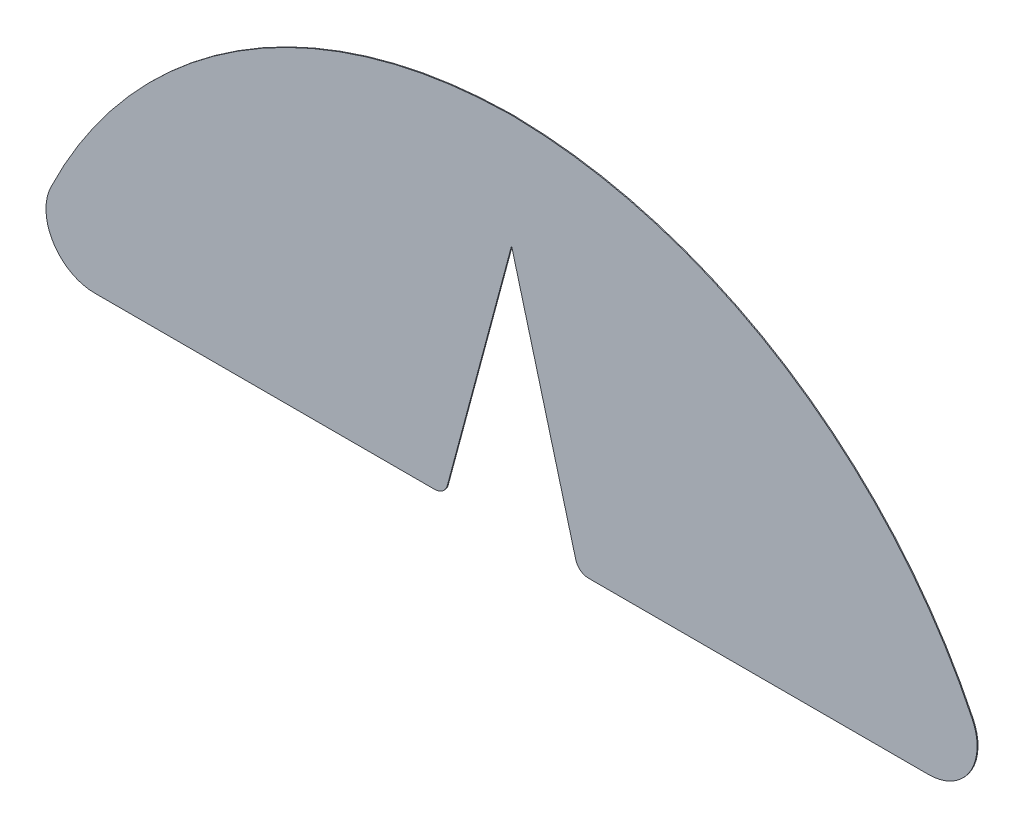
from build123d import *

# Parameters (mm, degrees)
EXTRUSION1_DEPTH = 0.2


with BuildPart() as part:
    # Esquisse1 → Extrusion1 (new body)
    with BuildSketch(Plane.XY):
        with BuildLine():
            Line((1, 1.003940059), (1, -20.858089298))
            Line((1, -20.858089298), (-14.518121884, -78.772508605))
            ThreePointArc((-14.518121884, -78.772508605), (-15.589615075, -80.376111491), (-17.415899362, -80.99605147))
            Line((-17.415899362, -80.99605147), (-94.307241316, -80.99605147))
            ThreePointArc((-94.307241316, -80.99605147), (-103.614933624, -75.85837728), (-104.22810038, -65.24457218))
            ThreePointArc((-104.22810038, -65.24457218), (-61.179618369, -16.926517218), (1, 1.003940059))
        make_face()
    extrusion1 = extrude(amount=EXTRUSION1_DEPTH)

    # Sym_trie1: Extrusion1 across plane
    add(extrusion1.mirror(Plane(origin=(0, 0, 0), x_dir=(0, 0, 1), z_dir=(1, 0, 0))))


solid = part.part
